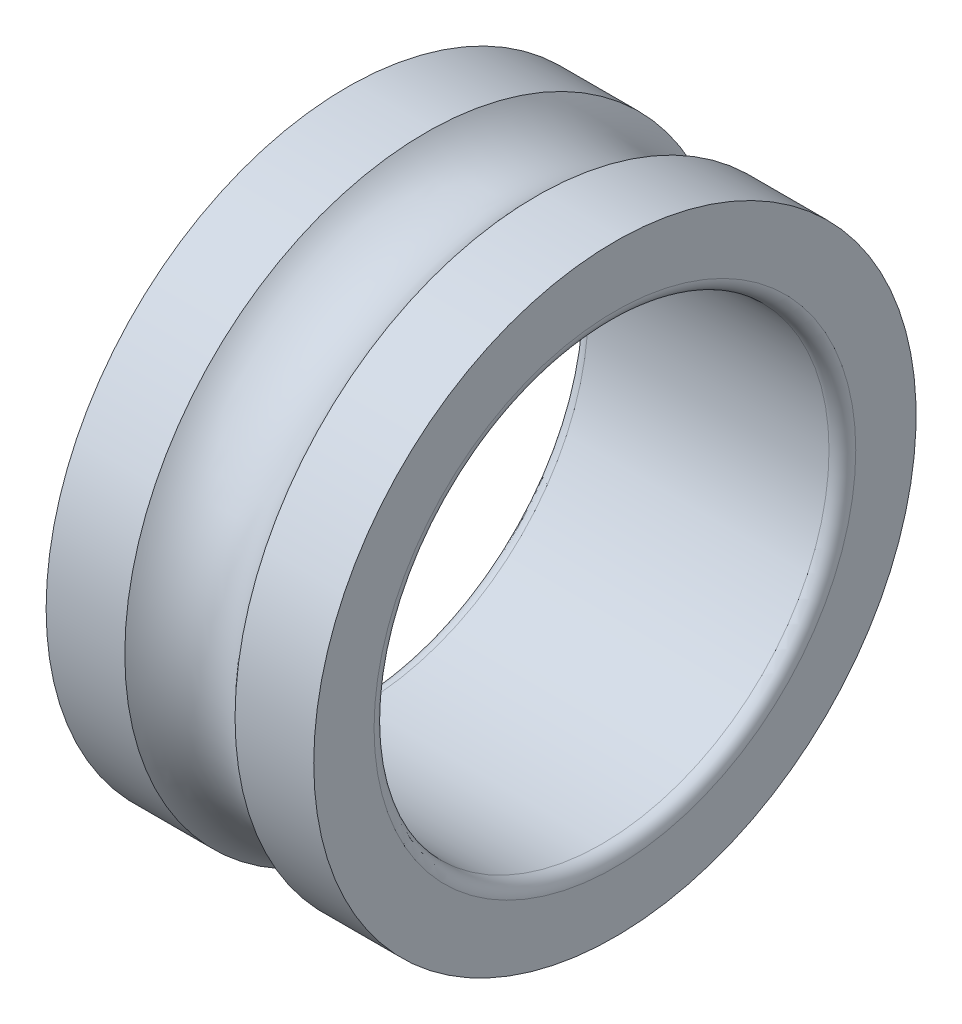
ISO-10303-21;
HEADER;
FILE_DESCRIPTION(('STEP AP214'),'2;1');
FILE_NAME('part.step','',(''),(''),'','','');
FILE_SCHEMA(('AUTOMOTIVE_DESIGN { 1 0 10303 214 1 1 1 1 }'));
ENDSEC;
DATA;
#1=APPLICATION_CONTEXT('core data for automotive mechanical design processes');
#2=APPLICATION_PROTOCOL_DEFINITION('international standard','automotive_design',2000,#1);
#3=PRODUCT_CONTEXT('',#1,'mechanical');
#4=PRODUCT('Part','Part','',(#3));
#5=PRODUCT_RELATED_PRODUCT_CATEGORY('part','',(#4));
#6=PRODUCT_DEFINITION_FORMATION('','',#4);
#7=PRODUCT_DEFINITION_CONTEXT('part definition',#1,'design');
#8=PRODUCT_DEFINITION('design','',#6,#7);
#9=PRODUCT_DEFINITION_SHAPE('','',#8);
#10=(LENGTH_UNIT() NAMED_UNIT(*) SI_UNIT(.MILLI.,.METRE.));
#11=(NAMED_UNIT(*) PLANE_ANGLE_UNIT() SI_UNIT($,.RADIAN.));
#12=(NAMED_UNIT(*) SI_UNIT($,.STERADIAN.) SOLID_ANGLE_UNIT());
#13=UNCERTAINTY_MEASURE_WITH_UNIT(LENGTH_MEASURE(1.E-05),#10,'distance_accuracy_value','');
#14=(GEOMETRIC_REPRESENTATION_CONTEXT(3) GLOBAL_UNCERTAINTY_ASSIGNED_CONTEXT((#13)) GLOBAL_UNIT_ASSIGNED_CONTEXT((#10,
#11,#12)) REPRESENTATION_CONTEXT('',''));
#15=CARTESIAN_POINT('',(0.,0.,0.));
#16=DIRECTION('',(0.,0.,1.));
#17=DIRECTION('',(1.,0.,0.));
#18=AXIS2_PLACEMENT_3D('',#15,#16,#17);
#19=CARTESIAN_POINT('',(10.,0.,0.));
#20=DIRECTION('',(-1.,0.,0.));
#21=DIRECTION('',(0.,0.,1.));
#22=AXIS2_PLACEMENT_3D('',#19,#20,#21);
#23=CYLINDRICAL_SURFACE('',#22,11.254);
#24=CARTESIAN_POINT('',(0.,0.,0.));
#25=DIRECTION('',(-1.,0.,0.));
#26=DIRECTION('',(0.,0.,1.));
#27=AXIS2_PLACEMENT_3D('',#24,#25,#26);
#28=CIRCLE('',#27,11.254);
#29=CARTESIAN_POINT('',(0.,0.,11.254));
#30=VERTEX_POINT('',#29);
#31=EDGE_CURVE('E10',#30,#30,#28,.T.);
#32=ORIENTED_EDGE('',*,*,#31,.F.);
#33=EDGE_LOOP('',(#32));
#34=FACE_BOUND('',#33,.T.);
#35=CARTESIAN_POINT('',(2.94051365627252,0.,0.));
#36=DIRECTION('',(-1.,0.,0.));
#37=DIRECTION('',(0.,0.,1.));
#38=AXIS2_PLACEMENT_3D('',#35,#36,#37);
#39=CIRCLE('',#38,11.254);
#40=CARTESIAN_POINT('',(2.94051365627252,0.,11.254));
#41=VERTEX_POINT('',#40);
#42=EDGE_CURVE('E63',#41,#41,#39,.T.);
#43=ORIENTED_EDGE('',*,*,#42,.T.);
#44=EDGE_LOOP('',(#43));
#45=FACE_BOUND('',#44,.T.);
#46=ADVANCED_FACE('F35',(#34,#45),#23,.T.);
#47=CARTESIAN_POINT('',(0.,11.254,0.));
#48=DIRECTION('',(1.,0.,0.));
#49=DIRECTION('',(0.,0.,-1.));
#50=AXIS2_PLACEMENT_3D('',#47,#48,#49);
#51=PLANE('',#50);
#52=CARTESIAN_POINT('',(0.,0.,0.));
#53=DIRECTION('',(-1.,0.,0.));
#54=DIRECTION('',(0.,0.,1.));
#55=AXIS2_PLACEMENT_3D('',#52,#53,#54);
#56=CIRCLE('',#55,9.);
#57=CARTESIAN_POINT('',(0.,0.,9.));
#58=VERTEX_POINT('',#57);
#59=EDGE_CURVE('E41',#58,#58,#56,.T.);
#60=ORIENTED_EDGE('',*,*,#59,.F.);
#61=EDGE_LOOP('',(#60));
#62=FACE_BOUND('',#61,.T.);
#63=ORIENTED_EDGE('',*,*,#31,.T.);
#64=EDGE_LOOP('',(#63));
#65=FACE_BOUND('',#64,.T.);
#66=ADVANCED_FACE('F100',(#62,#65),#51,.F.);
#67=CARTESIAN_POINT('',(0.500000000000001,0.,0.));
#68=DIRECTION('',(-1.,0.,0.));
#69=DIRECTION('',(0.,0.,1.));
#70=AXIS2_PLACEMENT_3D('',#67,#68,#69);
#71=TOROIDAL_SURFACE('',#70,9.,0.500000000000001);
#72=CARTESIAN_POINT('',(0.5,0.,0.));
#73=DIRECTION('',(-1.,0.,0.));
#74=DIRECTION('',(0.,0.,1.));
#75=AXIS2_PLACEMENT_3D('',#72,#73,#74);
#76=CIRCLE('',#75,8.5);
#77=CARTESIAN_POINT('',(0.5,0.,8.5));
#78=VERTEX_POINT('',#77);
#79=EDGE_CURVE('E45',#78,#78,#76,.T.);
#80=ORIENTED_EDGE('',*,*,#79,.F.);
#81=EDGE_LOOP('',(#80));
#82=FACE_BOUND('',#81,.T.);
#83=ORIENTED_EDGE('',*,*,#59,.T.);
#84=EDGE_LOOP('',(#83));
#85=FACE_BOUND('',#84,.T.);
#86=ADVANCED_FACE('F95',(#82,#85),#71,.T.);
#87=CARTESIAN_POINT('',(10.,0.,0.));
#88=DIRECTION('',(-1.,0.,0.));
#89=DIRECTION('',(0.,0.,1.));
#90=AXIS2_PLACEMENT_3D('',#87,#88,#89);
#91=CYLINDRICAL_SURFACE('',#90,8.5);
#92=CARTESIAN_POINT('',(9.5,0.,0.));
#93=DIRECTION('',(-1.,0.,0.));
#94=DIRECTION('',(0.,0.,1.));
#95=AXIS2_PLACEMENT_3D('',#92,#93,#94);
#96=CIRCLE('',#95,8.5);
#97=CARTESIAN_POINT('',(9.5,0.,8.5));
#98=VERTEX_POINT('',#97);
#99=EDGE_CURVE('E49',#98,#98,#96,.T.);
#100=ORIENTED_EDGE('',*,*,#99,.F.);
#101=EDGE_LOOP('',(#100));
#102=FACE_BOUND('',#101,.T.);
#103=ORIENTED_EDGE('',*,*,#79,.T.);
#104=EDGE_LOOP('',(#103));
#105=FACE_BOUND('',#104,.T.);
#106=ADVANCED_FACE('F89',(#102,#105),#91,.F.);
#107=CARTESIAN_POINT('',(9.5,0.,0.));
#108=DIRECTION('',(-1.,0.,0.));
#109=DIRECTION('',(0.,0.,1.));
#110=AXIS2_PLACEMENT_3D('',#107,#108,#109);
#111=TOROIDAL_SURFACE('',#110,9.,0.499999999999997);
#112=CARTESIAN_POINT('',(10.,0.,0.));
#113=DIRECTION('',(-1.,0.,0.));
#114=DIRECTION('',(0.,0.,1.));
#115=AXIS2_PLACEMENT_3D('',#112,#113,#114);
#116=CIRCLE('',#115,9.);
#117=CARTESIAN_POINT('',(10.,0.,9.));
#118=VERTEX_POINT('',#117);
#119=EDGE_CURVE('E54',#118,#118,#116,.T.);
#120=ORIENTED_EDGE('',*,*,#119,.F.);
#121=EDGE_LOOP('',(#120));
#122=FACE_BOUND('',#121,.T.);
#123=ORIENTED_EDGE('',*,*,#99,.T.);
#124=EDGE_LOOP('',(#123));
#125=FACE_BOUND('',#124,.T.);
#126=ADVANCED_FACE('F83',(#122,#125),#111,.T.);
#127=CARTESIAN_POINT('',(10.,9.,0.));
#128=DIRECTION('',(-1.,0.,0.));
#129=DIRECTION('',(0.,0.,1.));
#130=AXIS2_PLACEMENT_3D('',#127,#128,#129);
#131=PLANE('',#130);
#132=CARTESIAN_POINT('',(10.,0.,0.));
#133=DIRECTION('',(-1.,0.,0.));
#134=DIRECTION('',(0.,0.,1.));
#135=AXIS2_PLACEMENT_3D('',#132,#133,#134);
#136=CIRCLE('',#135,11.254);
#137=CARTESIAN_POINT('',(10.,0.,11.254));
#138=VERTEX_POINT('',#137);
#139=EDGE_CURVE('E57',#138,#138,#136,.T.);
#140=ORIENTED_EDGE('',*,*,#139,.F.);
#141=EDGE_LOOP('',(#140));
#142=FACE_BOUND('',#141,.T.);
#143=ORIENTED_EDGE('',*,*,#119,.T.);
#144=EDGE_LOOP('',(#143));
#145=FACE_BOUND('',#144,.T.);
#146=ADVANCED_FACE('F77',(#142,#145),#131,.F.);
#147=CARTESIAN_POINT('',(10.,0.,0.));
#148=DIRECTION('',(-1.,0.,0.));
#149=DIRECTION('',(0.,0.,1.));
#150=AXIS2_PLACEMENT_3D('',#147,#148,#149);
#151=CYLINDRICAL_SURFACE('',#150,11.254);
#152=CARTESIAN_POINT('',(7.05948634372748,0.,0.));
#153=DIRECTION('',(-1.,0.,0.));
#154=DIRECTION('',(0.,0.,1.));
#155=AXIS2_PLACEMENT_3D('',#152,#153,#154);
#156=CIRCLE('',#155,11.254);
#157=CARTESIAN_POINT('',(7.05948634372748,0.,11.254));
#158=VERTEX_POINT('',#157);
#159=EDGE_CURVE('E60',#158,#158,#156,.T.);
#160=ORIENTED_EDGE('',*,*,#159,.F.);
#161=EDGE_LOOP('',(#160));
#162=FACE_BOUND('',#161,.T.);
#163=ORIENTED_EDGE('',*,*,#139,.T.);
#164=EDGE_LOOP('',(#163));
#165=FACE_BOUND('',#164,.T.);
#166=ADVANCED_FACE('F71',(#162,#165),#151,.T.);
#167=CARTESIAN_POINT('',(5.,0.,0.));
#168=DIRECTION('',(-1.,0.,0.));
#169=DIRECTION('',(0.,0.,1.));
#170=AXIS2_PLACEMENT_3D('',#167,#168,#169);
#171=TOROIDAL_SURFACE('',#170,13.,2.7);
#172=ORIENTED_EDGE('',*,*,#42,.F.);
#173=EDGE_LOOP('',(#172));
#174=FACE_BOUND('',#173,.T.);
#175=ORIENTED_EDGE('',*,*,#159,.T.);
#176=EDGE_LOOP('',(#175));
#177=FACE_BOUND('',#176,.T.);
#178=ADVANCED_FACE('F68',(#174,#177),#171,.F.);
#179=CLOSED_SHELL('',(#46,#66,#86,#106,#126,#146,#166,#178));
#180=MANIFOLD_SOLID_BREP('B2',#179);
#181=ADVANCED_BREP_SHAPE_REPRESENTATION('',(#18,#180),#14);
#182=SHAPE_DEFINITION_REPRESENTATION(#9,#181);
ENDSEC;
END-ISO-10303-21;
